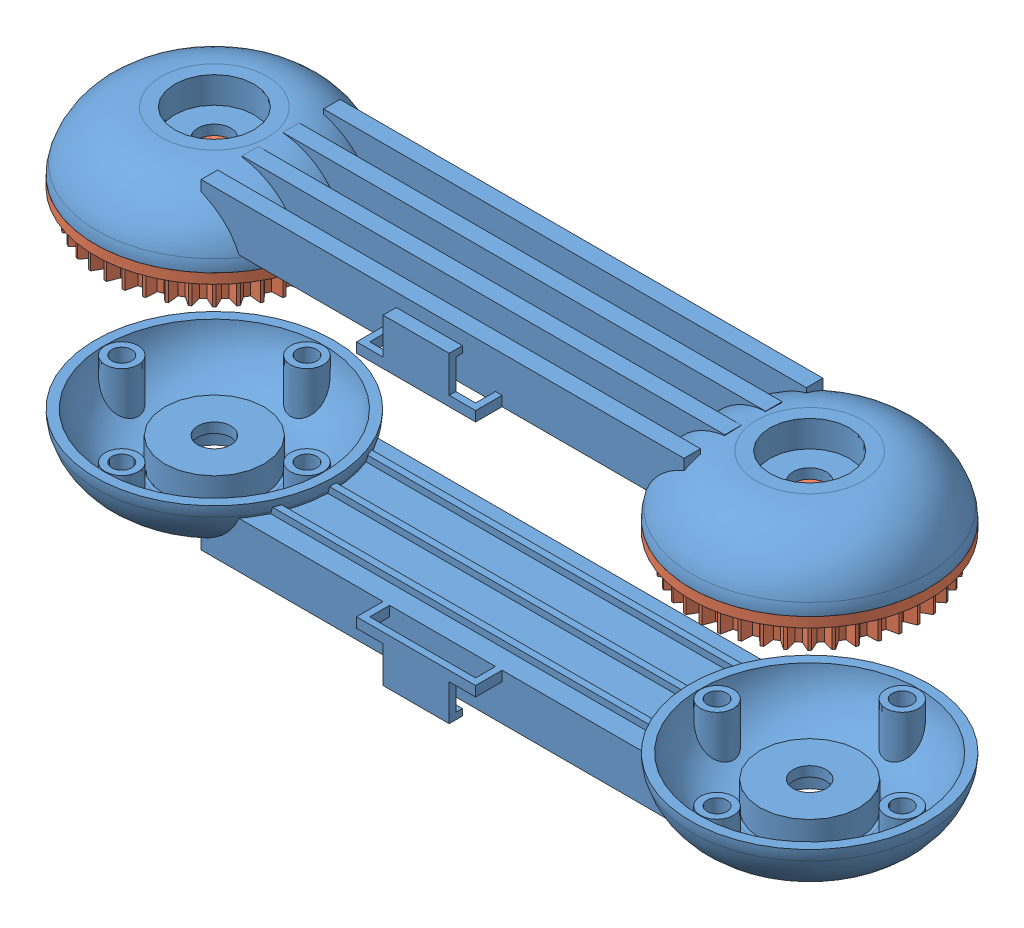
SolidWorks assembly BDM - Brazos.sldasm, configuration Predeterminado (file format 6000). Lengths in mm.
Overall size (126 49.66 36).
4 component instances, 2 part files, 0 mates.
Components (placement in the parent):
- RDM - Brazo M2 - M3-1: RDM - Brazo M2 - M3.sldprt [Predeterminado] at origin size (126 9.58 36)
- RDM - Engrane-1: RDM - Engrane.sldprt [Predeterminado] at (-45 -6.5 0) x (1 0 0) z (0 0 -1) size (36 10.5 36)
- RDM - Engrane-2: RDM - Engrane.sldprt [Predeterminado] at (45 -6.5 0) x (-1 0 0) z (0 0 1) size (36 10.5 36)
- RDM - Brazo M2 - M3-2: RDM - Brazo M2 - M3.sldprt [Predeterminado] at (0 -48.5 0) x (-1 0 0) z (0 0 1) size (126 9.58 36)
